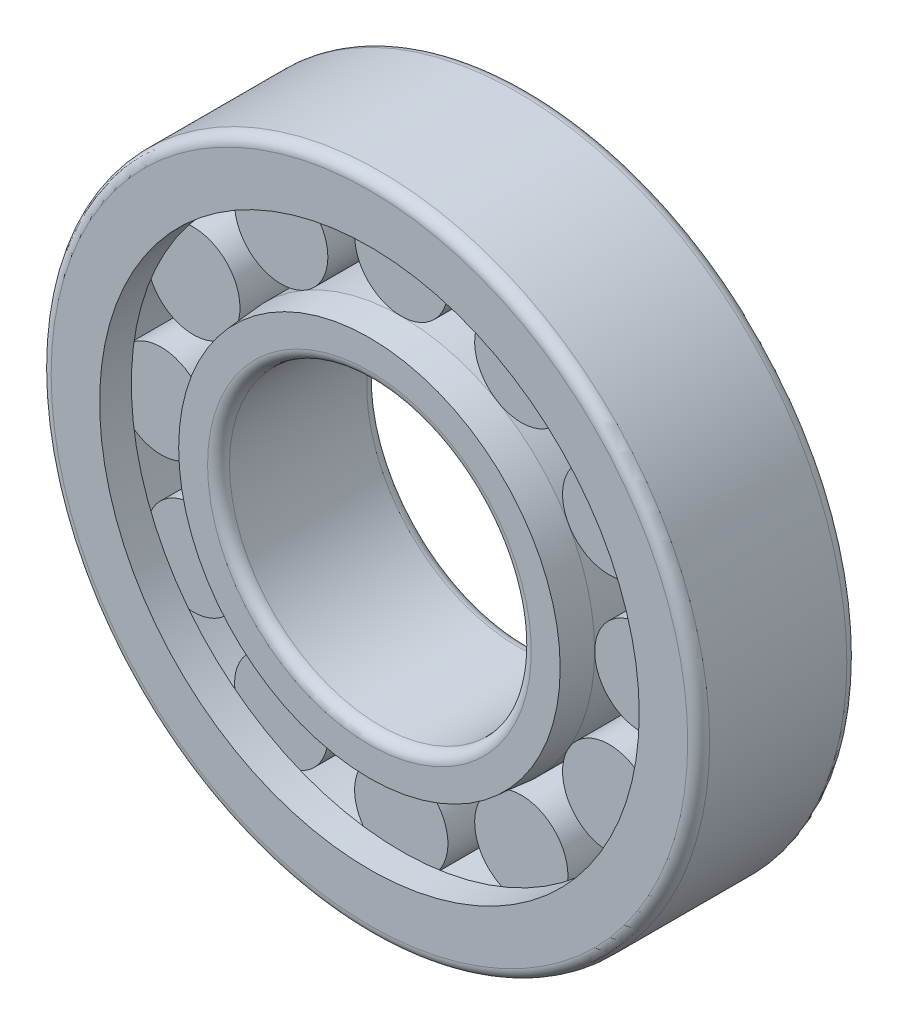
from build123d import *

# Parameters (mm, degrees)
BASESKE_W            = 17.4
BASESKE_H            = 8.5
FILLET1_R            = 2
CIRPATTERNBALL_COUNT = 12


with BuildPart() as part:
    # BaseSke → Roller (revolve)
    with BuildSketch(Plane(origin=(0, 0, 0), x_dir=(0, 0, -1), z_dir=(1, 0, 0)), mode=Mode.PRIVATE) as roller_sk:
        with Locations((0, 39.5)):
            Rectangle(BASESKE_W, BASESKE_H)
    roller = revolve(roller_sk.sketch.rotate(Axis((0, 43.75, 8.7), (0, 0, -1)), 270), axis=Axis((0, 43.75, 8.7), (0, 0, -1)))

    # OuterRaceSke → OuterRace (revolve)
    with BuildSketch(Plane(origin=(0, 0, 0), x_dir=(0, 0, -1), z_dir=(1, 0, 0)), mode=Mode.PRIVATE) as outerrace_sk:
        Polygon((-14.5, 60), (14.5, 60), (14.5, 49.166666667), (8.725, 49.166666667), (8.725, 52.23), (-8.725, 52.23), (-8.725, 49.166666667), (-14.5, 49.166666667), align=None)
    revolve(outerrace_sk.sketch.rotate(Axis((0, 0, 50.391616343), (0, 0, -1)), 90), axis=Axis((0, 0, 50.391616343), (0, 0, -1)))

    # InnerRaceSke → InnerRace (revolve)
    with BuildSketch(Plane(origin=(0, 0, 0), x_dir=(0, 0, -1), z_dir=(1, 0, 0)), mode=Mode.PRIVATE) as innerrace_sk:
        Polygon((-14.5, 27.5), (14.5, 27.5), (14.5, 38.333333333), (8.725, 38.333333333), (8.725, 35.27), (-8.725, 35.27), (-8.725, 38.333333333), (-14.5, 38.333333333), align=None)
    revolve(innerrace_sk.sketch.rotate(Axis((0, 0, 70.862590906), (0, 0, -1)), 90), axis=Axis((0, 0, 70.862590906), (0, 0, -1)))

    # Fillet1
    fillet1_edges = [part.edges().sort_by_distance(p)[0] for p in [
        (-60, 0, 14.5),
        (-60, 0, -14.5),
        (-27.5, 0, 14.5),
        (-27.5, 0, -14.5),
    ]]
    fillet(fillet1_edges, radius=FILLET1_R)

    # NJSke → NJ (revolve, cut)
    with BuildSketch(Plane(origin=(0, 0, 0), x_dir=(0, 0, -1), z_dir=(1, 0, 0)), mode=Mode.PRIVATE) as nj_sk:
        Polygon((14.5, 38.333333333), (8.725, 38.333333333), (8.725, 35.27), (14.5, 34.764752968), align=None)
    nj = revolve(nj_sk.sketch.rotate(Axis((0, 0, 35.607790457), (0, 0, -1)), 270), axis=Axis((0, 0, 35.607790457), (0, 0, -1)), mode=Mode.SUBTRACT)

    # NU: NJ across plane
    add(nj.mirror(Plane.XY), mode=Mode.SUBTRACT)

    # CirPatternBall: Roller ×12 about axis
    cirpatternball_axis = Axis((0, 0, 0), (0, 0, 1))
    for i in range(1, CIRPATTERNBALL_COUNT):
        add(roller.rotate(cirpatternball_axis, i * 360 / CIRPATTERNBALL_COUNT))


solid = part.part
